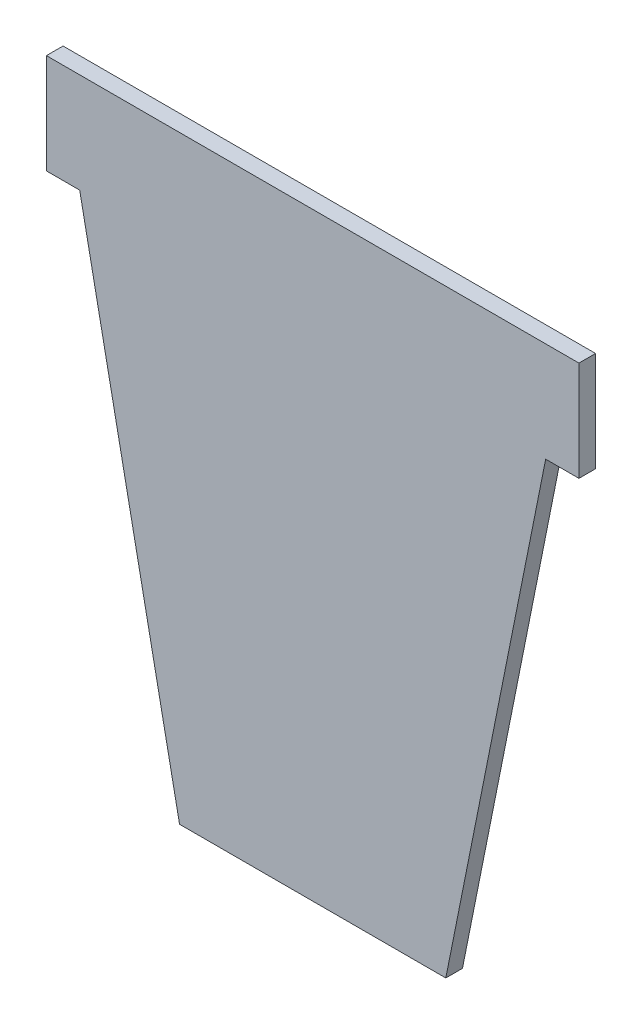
ISO-10303-21;
HEADER;
FILE_DESCRIPTION(('STEP AP214'),'2;1');
FILE_NAME('part.step','',(''),(''),'','','');
FILE_SCHEMA(('AUTOMOTIVE_DESIGN { 1 0 10303 214 1 1 1 1 }'));
ENDSEC;
DATA;
#1=APPLICATION_CONTEXT('core data for automotive mechanical design processes');
#2=APPLICATION_PROTOCOL_DEFINITION('international standard','automotive_design',2000,#1);
#3=PRODUCT_CONTEXT('',#1,'mechanical');
#4=PRODUCT('Part','Part','',(#3));
#5=PRODUCT_RELATED_PRODUCT_CATEGORY('part','',(#4));
#6=PRODUCT_DEFINITION_FORMATION('','',#4);
#7=PRODUCT_DEFINITION_CONTEXT('part definition',#1,'design');
#8=PRODUCT_DEFINITION('design','',#6,#7);
#9=PRODUCT_DEFINITION_SHAPE('','',#8);
#10=(LENGTH_UNIT() NAMED_UNIT(*) SI_UNIT(.MILLI.,.METRE.));
#11=(NAMED_UNIT(*) PLANE_ANGLE_UNIT() SI_UNIT($,.RADIAN.));
#12=(NAMED_UNIT(*) SI_UNIT($,.STERADIAN.) SOLID_ANGLE_UNIT());
#13=UNCERTAINTY_MEASURE_WITH_UNIT(LENGTH_MEASURE(1.E-05),#10,'distance_accuracy_value','');
#14=(GEOMETRIC_REPRESENTATION_CONTEXT(3) GLOBAL_UNCERTAINTY_ASSIGNED_CONTEXT((#13)) GLOBAL_UNIT_ASSIGNED_CONTEXT((#10,
#11,#12)) REPRESENTATION_CONTEXT('',''));
#15=CARTESIAN_POINT('',(0.,0.,0.));
#16=DIRECTION('',(0.,0.,1.));
#17=DIRECTION('',(1.,0.,0.));
#18=AXIS2_PLACEMENT_3D('',#15,#16,#17);
#19=CARTESIAN_POINT('',(0.,0.,6.35));
#20=DIRECTION('',(1.,0.,0.));
#21=DIRECTION('',(0.,1.,0.));
#22=AXIS2_PLACEMENT_3D('',#19,#20,#21);
#23=PLANE('',#22);
#24=DIRECTION('',(0.,-1.,0.));
#25=VECTOR('',#24,1.);
#26=CARTESIAN_POINT('',(0.,0.,0.));
#27=LINE('',#26,#25);
#28=CARTESIAN_POINT('',(0.,0.,0.));
#29=VERTEX_POINT('',#28);
#30=CARTESIAN_POINT('',(0.,-38.1,0.));
#31=VERTEX_POINT('',#30);
#32=EDGE_CURVE('E129',#29,#31,#27,.T.);
#33=ORIENTED_EDGE('',*,*,#32,.T.);
#34=DIRECTION('',(0.,0.,-1.));
#35=VECTOR('',#34,1.);
#36=CARTESIAN_POINT('',(0.,-38.1,6.35));
#37=LINE('',#36,#35);
#38=CARTESIAN_POINT('',(0.,-38.1,6.35));
#39=VERTEX_POINT('',#38);
#40=EDGE_CURVE('E11',#39,#31,#37,.T.);
#41=ORIENTED_EDGE('',*,*,#40,.F.);
#42=DIRECTION('',(0.,-1.,0.));
#43=VECTOR('',#42,1.);
#44=CARTESIAN_POINT('',(0.,0.,6.35));
#45=LINE('',#44,#43);
#46=CARTESIAN_POINT('',(0.,0.,6.35));
#47=VERTEX_POINT('',#46);
#48=EDGE_CURVE('E143',#47,#39,#45,.T.);
#49=ORIENTED_EDGE('',*,*,#48,.F.);
#50=DIRECTION('',(0.,0.,-1.));
#51=VECTOR('',#50,1.);
#52=CARTESIAN_POINT('',(0.,0.,6.35));
#53=LINE('',#52,#51);
#54=EDGE_CURVE('E125',#47,#29,#53,.T.);
#55=ORIENTED_EDGE('',*,*,#54,.T.);
#56=EDGE_LOOP('',(#33,#41,#49,#55));
#57=FACE_BOUND('',#56,.T.);
#58=ADVANCED_FACE('F33',(#57),#23,.F.);
#59=CARTESIAN_POINT('',(0.,-38.1,6.35));
#60=DIRECTION('',(0.,1.,0.));
#61=DIRECTION('',(0.,0.,1.));
#62=AXIS2_PLACEMENT_3D('',#59,#60,#61);
#63=PLANE('',#62);
#64=DIRECTION('',(1.,0.,0.));
#65=VECTOR('',#64,1.);
#66=CARTESIAN_POINT('',(0.,-38.1,0.));
#67=LINE('',#66,#65);
#68=CARTESIAN_POINT('',(12.7,-38.1,0.));
#69=VERTEX_POINT('',#68);
#70=EDGE_CURVE('E132',#31,#69,#67,.T.);
#71=ORIENTED_EDGE('',*,*,#70,.T.);
#72=DIRECTION('',(0.,0.,-1.));
#73=VECTOR('',#72,1.);
#74=CARTESIAN_POINT('',(12.7,-38.1,6.35));
#75=LINE('',#74,#73);
#76=CARTESIAN_POINT('',(12.7,-38.1,6.35));
#77=VERTEX_POINT('',#76);
#78=EDGE_CURVE('E41',#77,#69,#75,.T.);
#79=ORIENTED_EDGE('',*,*,#78,.F.);
#80=DIRECTION('',(1.,0.,0.));
#81=VECTOR('',#80,1.);
#82=CARTESIAN_POINT('',(0.,-38.1,6.35));
#83=LINE('',#82,#81);
#84=EDGE_CURVE('E92',#39,#77,#83,.T.);
#85=ORIENTED_EDGE('',*,*,#84,.F.);
#86=ORIENTED_EDGE('',*,*,#40,.T.);
#87=EDGE_LOOP('',(#71,#79,#85,#86));
#88=FACE_BOUND('',#87,.T.);
#89=ADVANCED_FACE('F178',(#88),#63,.F.);
#90=CARTESIAN_POINT('',(12.7,-38.1,6.35));
#91=DIRECTION('',(0.98058067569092,0.196116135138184,0.));
#92=DIRECTION('',(-0.196116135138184,0.98058067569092,0.));
#93=AXIS2_PLACEMENT_3D('',#90,#91,#92);
#94=PLANE('',#93);
#95=DIRECTION('',(0.196116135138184,-0.98058067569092,0.));
#96=VECTOR('',#95,1.);
#97=CARTESIAN_POINT('',(12.7,-38.1,0.));
#98=LINE('',#97,#96);
#99=CARTESIAN_POINT('',(50.8,-228.6,0.));
#100=VERTEX_POINT('',#99);
#101=EDGE_CURVE('E134',#69,#100,#98,.T.);
#102=ORIENTED_EDGE('',*,*,#101,.T.);
#103=DIRECTION('',(0.,0.,-1.));
#104=VECTOR('',#103,1.);
#105=CARTESIAN_POINT('',(50.8,-228.6,6.35));
#106=LINE('',#105,#104);
#107=CARTESIAN_POINT('',(50.8,-228.6,6.35));
#108=VERTEX_POINT('',#107);
#109=EDGE_CURVE('E150',#108,#100,#106,.T.);
#110=ORIENTED_EDGE('',*,*,#109,.F.);
#111=DIRECTION('',(0.196116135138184,-0.98058067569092,0.));
#112=VECTOR('',#111,1.);
#113=CARTESIAN_POINT('',(12.7,-38.1,6.35));
#114=LINE('',#113,#112);
#115=EDGE_CURVE('E158',#77,#108,#114,.T.);
#116=ORIENTED_EDGE('',*,*,#115,.F.);
#117=ORIENTED_EDGE('',*,*,#78,.T.);
#118=EDGE_LOOP('',(#102,#110,#116,#117));
#119=FACE_BOUND('',#118,.T.);
#120=ADVANCED_FACE('F156',(#119),#94,.F.);
#121=CARTESIAN_POINT('',(50.8,-228.6,6.35));
#122=DIRECTION('',(0.,1.,0.));
#123=DIRECTION('',(0.,0.,1.));
#124=AXIS2_PLACEMENT_3D('',#121,#122,#123);
#125=PLANE('',#124);
#126=DIRECTION('',(1.,0.,0.));
#127=VECTOR('',#126,1.);
#128=CARTESIAN_POINT('',(50.8,-228.6,0.));
#129=LINE('',#128,#127);
#130=CARTESIAN_POINT('',(152.4,-228.6,0.));
#131=VERTEX_POINT('',#130);
#132=EDGE_CURVE('E136',#100,#131,#129,.T.);
#133=ORIENTED_EDGE('',*,*,#132,.T.);
#134=DIRECTION('',(0.,0.,-1.));
#135=VECTOR('',#134,1.);
#136=CARTESIAN_POINT('',(152.4,-228.6,6.35));
#137=LINE('',#136,#135);
#138=CARTESIAN_POINT('',(152.4,-228.6,6.35));
#139=VERTEX_POINT('',#138);
#140=EDGE_CURVE('E147',#139,#131,#137,.T.);
#141=ORIENTED_EDGE('',*,*,#140,.F.);
#142=DIRECTION('',(1.,0.,0.));
#143=VECTOR('',#142,1.);
#144=CARTESIAN_POINT('',(50.8,-228.6,6.35));
#145=LINE('',#144,#143);
#146=EDGE_CURVE('E170',#108,#139,#145,.T.);
#147=ORIENTED_EDGE('',*,*,#146,.F.);
#148=ORIENTED_EDGE('',*,*,#109,.T.);
#149=EDGE_LOOP('',(#133,#141,#147,#148));
#150=FACE_BOUND('',#149,.T.);
#151=ADVANCED_FACE('F166',(#150),#125,.F.);
#152=CARTESIAN_POINT('',(152.4,-228.6,6.35));
#153=DIRECTION('',(-0.98058067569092,0.196116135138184,0.));
#154=DIRECTION('',(-0.196116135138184,-0.98058067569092,0.));
#155=AXIS2_PLACEMENT_3D('',#152,#153,#154);
#156=PLANE('',#155);
#157=DIRECTION('',(0.196116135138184,0.98058067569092,0.));
#158=VECTOR('',#157,1.);
#159=CARTESIAN_POINT('',(152.4,-228.6,0.));
#160=LINE('',#159,#158);
#161=CARTESIAN_POINT('',(190.5,-38.1,0.));
#162=VERTEX_POINT('',#161);
#163=EDGE_CURVE('E138',#131,#162,#160,.T.);
#164=ORIENTED_EDGE('',*,*,#163,.T.);
#165=DIRECTION('',(0.,0.,-1.));
#166=VECTOR('',#165,1.);
#167=CARTESIAN_POINT('',(190.5,-38.1,6.35));
#168=LINE('',#167,#166);
#169=CARTESIAN_POINT('',(190.5,-38.1,6.35));
#170=VERTEX_POINT('',#169);
#171=EDGE_CURVE('E120',#170,#162,#168,.T.);
#172=ORIENTED_EDGE('',*,*,#171,.F.);
#173=DIRECTION('',(0.196116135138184,0.98058067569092,0.));
#174=VECTOR('',#173,1.);
#175=CARTESIAN_POINT('',(152.4,-228.6,6.35));
#176=LINE('',#175,#174);
#177=EDGE_CURVE('E111',#139,#170,#176,.T.);
#178=ORIENTED_EDGE('',*,*,#177,.F.);
#179=ORIENTED_EDGE('',*,*,#140,.T.);
#180=EDGE_LOOP('',(#164,#172,#178,#179));
#181=FACE_BOUND('',#180,.T.);
#182=ADVANCED_FACE('F169',(#181),#156,.F.);
#183=CARTESIAN_POINT('',(203.2,-38.1,6.35));
#184=DIRECTION('',(0.,1.,0.));
#185=DIRECTION('',(-1.,0.,0.));
#186=AXIS2_PLACEMENT_3D('',#183,#184,#185);
#187=PLANE('',#186);
#188=DIRECTION('',(1.,0.,0.));
#189=VECTOR('',#188,1.);
#190=CARTESIAN_POINT('',(203.2,-38.1,0.));
#191=LINE('',#190,#189);
#192=CARTESIAN_POINT('',(203.2,-38.1,0.));
#193=VERTEX_POINT('',#192);
#194=EDGE_CURVE('E119',#162,#193,#191,.T.);
#195=ORIENTED_EDGE('',*,*,#194,.T.);
#196=DIRECTION('',(0.,0.,-1.));
#197=VECTOR('',#196,1.);
#198=CARTESIAN_POINT('',(203.2,-38.1,6.35));
#199=LINE('',#198,#197);
#200=CARTESIAN_POINT('',(203.2,-38.1,6.35));
#201=VERTEX_POINT('',#200);
#202=EDGE_CURVE('E116',#201,#193,#199,.T.);
#203=ORIENTED_EDGE('',*,*,#202,.F.);
#204=DIRECTION('',(1.,0.,0.));
#205=VECTOR('',#204,1.);
#206=CARTESIAN_POINT('',(203.2,-38.1,6.35));
#207=LINE('',#206,#205);
#208=EDGE_CURVE('E105',#170,#201,#207,.T.);
#209=ORIENTED_EDGE('',*,*,#208,.F.);
#210=ORIENTED_EDGE('',*,*,#171,.T.);
#211=EDGE_LOOP('',(#195,#203,#209,#210));
#212=FACE_BOUND('',#211,.T.);
#213=ADVANCED_FACE('F117',(#212),#187,.F.);
#214=CARTESIAN_POINT('',(203.2,0.,6.35));
#215=DIRECTION('',(-1.,0.,0.));
#216=DIRECTION('',(0.,0.,1.));
#217=AXIS2_PLACEMENT_3D('',#214,#215,#216);
#218=PLANE('',#217);
#219=DIRECTION('',(0.,1.,0.));
#220=VECTOR('',#219,1.);
#221=CARTESIAN_POINT('',(203.2,0.,0.));
#222=LINE('',#221,#220);
#223=CARTESIAN_POINT('',(203.2,0.,0.));
#224=VERTEX_POINT('',#223);
#225=EDGE_CURVE('E78',#193,#224,#222,.T.);
#226=ORIENTED_EDGE('',*,*,#225,.T.);
#227=DIRECTION('',(0.,0.,-1.));
#228=VECTOR('',#227,1.);
#229=CARTESIAN_POINT('',(203.2,0.,6.35));
#230=LINE('',#229,#228);
#231=CARTESIAN_POINT('',(203.2,0.,6.35));
#232=VERTEX_POINT('',#231);
#233=EDGE_CURVE('E121',#232,#224,#230,.T.);
#234=ORIENTED_EDGE('',*,*,#233,.F.);
#235=DIRECTION('',(0.,1.,0.));
#236=VECTOR('',#235,1.);
#237=CARTESIAN_POINT('',(203.2,0.,6.35));
#238=LINE('',#237,#236);
#239=EDGE_CURVE('E109',#201,#232,#238,.T.);
#240=ORIENTED_EDGE('',*,*,#239,.F.);
#241=ORIENTED_EDGE('',*,*,#202,.T.);
#242=EDGE_LOOP('',(#226,#234,#240,#241));
#243=FACE_BOUND('',#242,.T.);
#244=ADVANCED_FACE('F123',(#243),#218,.F.);
#245=CARTESIAN_POINT('',(0.,0.,6.35));
#246=DIRECTION('',(0.,-1.,0.));
#247=DIRECTION('',(0.,0.,-1.));
#248=AXIS2_PLACEMENT_3D('',#245,#246,#247);
#249=PLANE('',#248);
#250=DIRECTION('',(-1.,0.,0.));
#251=VECTOR('',#250,1.);
#252=CARTESIAN_POINT('',(0.,0.,0.));
#253=LINE('',#252,#251);
#254=EDGE_CURVE('E84',#224,#29,#253,.T.);
#255=ORIENTED_EDGE('',*,*,#254,.T.);
#256=ORIENTED_EDGE('',*,*,#54,.F.);
#257=DIRECTION('',(-1.,0.,0.));
#258=VECTOR('',#257,1.);
#259=CARTESIAN_POINT('',(0.,0.,6.35));
#260=LINE('',#259,#258);
#261=EDGE_CURVE('E49',#232,#47,#260,.T.);
#262=ORIENTED_EDGE('',*,*,#261,.F.);
#263=ORIENTED_EDGE('',*,*,#233,.T.);
#264=EDGE_LOOP('',(#255,#256,#262,#263));
#265=FACE_BOUND('',#264,.T.);
#266=ADVANCED_FACE('F194',(#265),#249,.F.);
#267=CARTESIAN_POINT('',(0.,0.,6.35));
#268=DIRECTION('',(0.,0.,1.));
#269=DIRECTION('',(1.,0.,0.));
#270=AXIS2_PLACEMENT_3D('',#267,#268,#269);
#271=PLANE('',#270);
#272=ORIENTED_EDGE('',*,*,#48,.T.);
#273=ORIENTED_EDGE('',*,*,#84,.T.);
#274=ORIENTED_EDGE('',*,*,#115,.T.);
#275=ORIENTED_EDGE('',*,*,#146,.T.);
#276=ORIENTED_EDGE('',*,*,#177,.T.);
#277=ORIENTED_EDGE('',*,*,#208,.T.);
#278=ORIENTED_EDGE('',*,*,#239,.T.);
#279=ORIENTED_EDGE('',*,*,#261,.T.);
#280=EDGE_LOOP('',(#272,#273,#274,#275,#276,#277,#278,#279));
#281=FACE_BOUND('',#280,.T.);
#282=ADVANCED_FACE('F107',(#281),#271,.T.);
#283=CARTESIAN_POINT('',(0.,0.,0.));
#284=DIRECTION('',(0.,0.,1.));
#285=DIRECTION('',(1.,0.,0.));
#286=AXIS2_PLACEMENT_3D('',#283,#284,#285);
#287=PLANE('',#286);
#288=ORIENTED_EDGE('',*,*,#32,.F.);
#289=ORIENTED_EDGE('',*,*,#254,.F.);
#290=ORIENTED_EDGE('',*,*,#225,.F.);
#291=ORIENTED_EDGE('',*,*,#194,.F.);
#292=ORIENTED_EDGE('',*,*,#163,.F.);
#293=ORIENTED_EDGE('',*,*,#132,.F.);
#294=ORIENTED_EDGE('',*,*,#101,.F.);
#295=ORIENTED_EDGE('',*,*,#70,.F.);
#296=EDGE_LOOP('',(#288,#289,#290,#291,#292,#293,#294,#295));
#297=FACE_BOUND('',#296,.T.);
#298=ADVANCED_FACE('F162',(#297),#287,.F.);
#299=CLOSED_SHELL('',(#58,#89,#120,#151,#182,#213,#244,#266,#282,#298));
#300=MANIFOLD_SOLID_BREP('B2',#299);
#301=ADVANCED_BREP_SHAPE_REPRESENTATION('',(#18,#300),#14);
#302=SHAPE_DEFINITION_REPRESENTATION(#9,#301);
ENDSEC;
END-ISO-10303-21;
